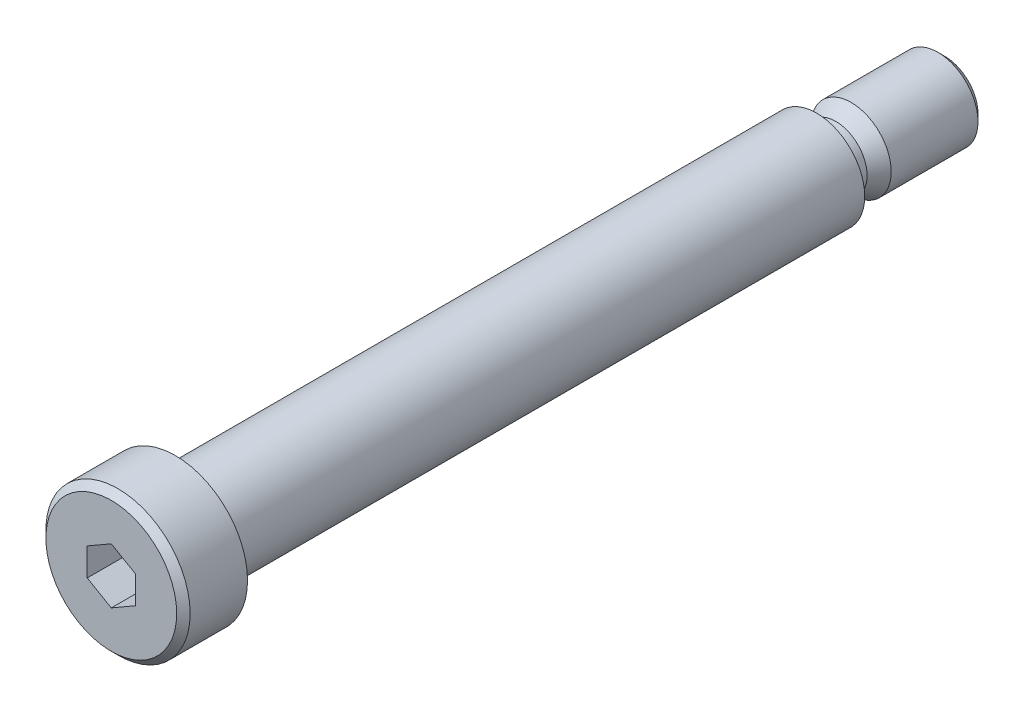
ISO-10303-21;
HEADER;
FILE_DESCRIPTION(('STEP AP214'),'2;1');
FILE_NAME('part.step','',(''),(''),'','','');
FILE_SCHEMA(('AUTOMOTIVE_DESIGN { 1 0 10303 214 1 1 1 1 }'));
ENDSEC;
DATA;
#1=APPLICATION_CONTEXT('core data for automotive mechanical design processes');
#2=APPLICATION_PROTOCOL_DEFINITION('international standard','automotive_design',2000,#1);
#3=PRODUCT_CONTEXT('',#1,'mechanical');
#4=PRODUCT('Part','Part','',(#3));
#5=PRODUCT_RELATED_PRODUCT_CATEGORY('part','',(#4));
#6=PRODUCT_DEFINITION_FORMATION('','',#4);
#7=PRODUCT_DEFINITION_CONTEXT('part definition',#1,'design');
#8=PRODUCT_DEFINITION('design','',#6,#7);
#9=PRODUCT_DEFINITION_SHAPE('','',#8);
#10=(LENGTH_UNIT() NAMED_UNIT(*) SI_UNIT(.MILLI.,.METRE.));
#11=(NAMED_UNIT(*) PLANE_ANGLE_UNIT() SI_UNIT($,.RADIAN.));
#12=(NAMED_UNIT(*) SI_UNIT($,.STERADIAN.) SOLID_ANGLE_UNIT());
#13=UNCERTAINTY_MEASURE_WITH_UNIT(LENGTH_MEASURE(1.E-05),#10,'distance_accuracy_value','');
#14=(GEOMETRIC_REPRESENTATION_CONTEXT(3) GLOBAL_UNCERTAINTY_ASSIGNED_CONTEXT((#13)) GLOBAL_UNIT_ASSIGNED_CONTEXT((#10,
#11,#12)) REPRESENTATION_CONTEXT('',''));
#15=CARTESIAN_POINT('',(0.,0.,0.));
#16=DIRECTION('',(0.,0.,1.));
#17=DIRECTION('',(1.,0.,0.));
#18=AXIS2_PLACEMENT_3D('',#15,#16,#17);
#19=CARTESIAN_POINT('',(0.,4.07999999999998,4.));
#20=DIRECTION('',(0.,0.,-1.));
#21=DIRECTION('',(-1.,0.,0.));
#22=AXIS2_PLACEMENT_3D('',#19,#20,#21);
#23=PLANE('',#22);
#24=CARTESIAN_POINT('',(0.,0.,4.));
#25=DIRECTION('',(0.,0.,1.));
#26=DIRECTION('',(1.,0.,0.));
#27=AXIS2_PLACEMENT_3D('',#24,#25,#26);
#28=CIRCLE('',#27,4.08);
#29=CARTESIAN_POINT('',(4.08,0.,4.));
#30=VERTEX_POINT('',#29);
#31=EDGE_CURVE('E154',#30,#30,#28,.T.);
#32=ORIENTED_EDGE('',*,*,#31,.T.);
#33=EDGE_LOOP('',(#32));
#34=FACE_BOUND('',#33,.T.);
#35=DIRECTION('',(0.,1.,0.));
#36=VECTOR('',#35,1.);
#37=CARTESIAN_POINT('',(1.5,4.07999999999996,4.));
#38=LINE('',#37,#36);
#39=CARTESIAN_POINT('',(1.5,-0.866025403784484,4.));
#40=VERTEX_POINT('',#39);
#41=CARTESIAN_POINT('',(1.5,0.866025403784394,4.));
#42=VERTEX_POINT('',#41);
#43=EDGE_CURVE('E11',#40,#42,#38,.T.);
#44=ORIENTED_EDGE('',*,*,#43,.F.);
#45=DIRECTION('',(0.866025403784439,0.5,0.));
#46=VECTOR('',#45,1.);
#47=CARTESIAN_POINT('',(2.51669182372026,-0.279038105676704,4.));
#48=LINE('',#47,#46);
#49=CARTESIAN_POINT('',(0.,-1.73205080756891,4.));
#50=VERTEX_POINT('',#49);
#51=EDGE_CURVE('E24',#50,#40,#48,.T.);
#52=ORIENTED_EDGE('',*,*,#51,.F.);
#53=DIRECTION('',(0.866025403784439,-0.5,0.));
#54=VECTOR('',#53,1.);
#55=CARTESIAN_POINT('',(-2.51669182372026,-0.279038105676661,4.));
#56=LINE('',#55,#54);
#57=CARTESIAN_POINT('',(-1.5,-0.866025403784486,4.));
#58=VERTEX_POINT('',#57);
#59=EDGE_CURVE('E210',#58,#50,#56,.T.);
#60=ORIENTED_EDGE('',*,*,#59,.F.);
#61=DIRECTION('',(0.,-1.,0.));
#62=VECTOR('',#61,1.);
#63=CARTESIAN_POINT('',(-1.5,4.07999999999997,4.));
#64=LINE('',#63,#62);
#65=CARTESIAN_POINT('',(-1.5,0.866025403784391,4.));
#66=VERTEX_POINT('',#65);
#67=EDGE_CURVE('E207',#66,#58,#64,.T.);
#68=ORIENTED_EDGE('',*,*,#67,.F.);
#69=DIRECTION('',(-0.866025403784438,-0.5,0.));
#70=VECTOR('',#69,1.);
#71=CARTESIAN_POINT('',(1.01669182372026,2.31903810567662,4.));
#72=LINE('',#71,#70);
#73=CARTESIAN_POINT('',(0.,1.73205080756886,4.));
#74=VERTEX_POINT('',#73);
#75=EDGE_CURVE('E204',#74,#66,#72,.T.);
#76=ORIENTED_EDGE('',*,*,#75,.F.);
#77=DIRECTION('',(-0.866025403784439,0.5,0.));
#78=VECTOR('',#77,1.);
#79=CARTESIAN_POINT('',(-1.01669182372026,2.31903810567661,4.));
#80=LINE('',#79,#78);
#81=EDGE_CURVE('E201',#42,#74,#80,.T.);
#82=ORIENTED_EDGE('',*,*,#81,.F.);
#83=EDGE_LOOP('',(#44,#52,#60,#68,#76,#82));
#84=FACE_BOUND('',#83,.T.);
#85=ADVANCED_FACE('F16',(#34,#84),#23,.F.);
#86=CARTESIAN_POINT('',(0.,0.,-48.));
#87=DIRECTION('',(0.,0.,1.));
#88=DIRECTION('',(1.,0.,0.));
#89=AXIS2_PLACEMENT_3D('',#86,#87,#88);
#90=PLANE('',#89);
#91=CARTESIAN_POINT('',(0.,0.,-48.));
#92=DIRECTION('',(0.,0.,1.));
#93=DIRECTION('',(1.,0.,0.));
#94=AXIS2_PLACEMENT_3D('',#91,#92,#93);
#95=CIRCLE('',#94,2.067);
#96=CARTESIAN_POINT('',(2.06700000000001,0.,-48.));
#97=VERTEX_POINT('',#96);
#98=EDGE_CURVE('E197',#97,#97,#95,.T.);
#99=ORIENTED_EDGE('',*,*,#98,.F.);
#100=EDGE_LOOP('',(#99));
#101=FACE_BOUND('',#100,.T.);
#102=ADVANCED_FACE('F222',(#101),#90,.F.);
#103=CARTESIAN_POINT('',(0.,0.,-48.));
#104=DIRECTION('',(0.,0.,1.));
#105=DIRECTION('',(1.,0.,0.));
#106=AXIS2_PLACEMENT_3D('',#103,#104,#105);
#107=CONICAL_SURFACE('',#106,2.067,0.785398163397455);
#108=CARTESIAN_POINT('',(3.7470027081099E-13,0.,-47.567));
#109=DIRECTION('',(0.,0.,1.));
#110=DIRECTION('',(1.,0.,0.));
#111=AXIS2_PLACEMENT_3D('',#108,#109,#110);
#112=CIRCLE('',#111,2.5);
#113=CARTESIAN_POINT('',(2.50000000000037,0.,-47.567));
#114=VERTEX_POINT('',#113);
#115=EDGE_CURVE('E193',#114,#114,#112,.T.);
#116=ORIENTED_EDGE('',*,*,#115,.F.);
#117=EDGE_LOOP('',(#116));
#118=FACE_BOUND('',#117,.T.);
#119=ORIENTED_EDGE('',*,*,#98,.T.);
#120=EDGE_LOOP('',(#119));
#121=FACE_BOUND('',#120,.T.);
#122=ADVANCED_FACE('F226',(#118,#121),#107,.T.);
#123=CARTESIAN_POINT('',(0.,0.,4.));
#124=DIRECTION('',(0.,0.,1.));
#125=DIRECTION('',(1.,0.,0.));
#126=AXIS2_PLACEMENT_3D('',#123,#124,#125);
#127=CYLINDRICAL_SURFACE('',#126,2.5);
#128=CARTESIAN_POINT('',(3.7470027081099E-13,0.,-42.1526279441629));
#129=DIRECTION('',(0.,0.,1.));
#130=DIRECTION('',(1.,0.,0.));
#131=AXIS2_PLACEMENT_3D('',#128,#129,#130);
#132=CIRCLE('',#131,2.5);
#133=CARTESIAN_POINT('',(2.50000000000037,0.,-42.1526279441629));
#134=VERTEX_POINT('',#133);
#135=EDGE_CURVE('E189',#134,#134,#132,.T.);
#136=ORIENTED_EDGE('',*,*,#135,.F.);
#137=EDGE_LOOP('',(#136));
#138=FACE_BOUND('',#137,.T.);
#139=ORIENTED_EDGE('',*,*,#115,.T.);
#140=EDGE_LOOP('',(#139));
#141=FACE_BOUND('',#140,.T.);
#142=ADVANCED_FACE('F237',(#138,#141),#127,.T.);
#143=CARTESIAN_POINT('',(3.7470027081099E-13,0.,-42.1526279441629));
#144=DIRECTION('',(0.,0.,-1.));
#145=DIRECTION('',(-1.,0.,0.));
#146=AXIS2_PLACEMENT_3D('',#143,#144,#145);
#147=CONICAL_SURFACE('',#146,2.5,0.523598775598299);
#148=CARTESIAN_POINT('',(3.7470027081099E-13,0.,-41.2));
#149=DIRECTION('',(0.,0.,1.));
#150=DIRECTION('',(1.,0.,0.));
#151=AXIS2_PLACEMENT_3D('',#148,#149,#150);
#152=CIRCLE('',#151,1.95);
#153=CARTESIAN_POINT('',(1.95000000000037,0.,-41.2));
#154=VERTEX_POINT('',#153);
#155=EDGE_CURVE('E185',#154,#154,#152,.T.);
#156=ORIENTED_EDGE('',*,*,#155,.F.);
#157=EDGE_LOOP('',(#156));
#158=FACE_BOUND('',#157,.T.);
#159=ORIENTED_EDGE('',*,*,#135,.T.);
#160=EDGE_LOOP('',(#159));
#161=FACE_BOUND('',#160,.T.);
#162=ADVANCED_FACE('F247',(#158,#161),#147,.T.);
#163=CARTESIAN_POINT('',(0.,0.,4.));
#164=DIRECTION('',(0.,0.,1.));
#165=DIRECTION('',(1.,0.,0.));
#166=AXIS2_PLACEMENT_3D('',#163,#164,#165);
#167=CYLINDRICAL_SURFACE('',#166,1.95);
#168=CARTESIAN_POINT('',(2.08166817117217E-13,0.,-40.4));
#169=DIRECTION('',(0.,0.,1.));
#170=DIRECTION('',(1.,0.,0.));
#171=AXIS2_PLACEMENT_3D('',#168,#169,#170);
#172=CIRCLE('',#171,1.95);
#173=CARTESIAN_POINT('',(1.95000000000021,0.,-40.4));
#174=VERTEX_POINT('',#173);
#175=EDGE_CURVE('E181',#174,#174,#172,.T.);
#176=ORIENTED_EDGE('',*,*,#175,.F.);
#177=EDGE_LOOP('',(#176));
#178=FACE_BOUND('',#177,.T.);
#179=ORIENTED_EDGE('',*,*,#155,.T.);
#180=EDGE_LOOP('',(#179));
#181=FACE_BOUND('',#180,.T.);
#182=ADVANCED_FACE('F257',(#178,#181),#167,.T.);
#183=CARTESIAN_POINT('',(2.08166817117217E-13,0.,-40.4));
#184=DIRECTION('',(0.,0.,1.));
#185=DIRECTION('',(1.,0.,0.));
#186=AXIS2_PLACEMENT_3D('',#183,#184,#185);
#187=TOROIDAL_SURFACE('',#186,2.35,0.4);
#188=ORIENTED_EDGE('',*,*,#175,.T.);
#189=EDGE_LOOP('',(#188));
#190=FACE_BOUND('',#189,.T.);
#191=CARTESIAN_POINT('',(2.08166817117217E-13,0.,-40.));
#192=DIRECTION('',(0.,0.,1.));
#193=DIRECTION('',(1.,0.,0.));
#194=AXIS2_PLACEMENT_3D('',#191,#192,#193);
#195=CIRCLE('',#194,2.35);
#196=CARTESIAN_POINT('',(2.35000000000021,0.,-40.));
#197=VERTEX_POINT('',#196);
#198=EDGE_CURVE('E177',#197,#197,#195,.T.);
#199=ORIENTED_EDGE('',*,*,#198,.F.);
#200=EDGE_LOOP('',(#199));
#201=FACE_BOUND('',#200,.T.);
#202=ADVANCED_FACE('F267',(#190,#201),#187,.F.);
#203=CARTESIAN_POINT('',(2.08166817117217E-13,2.34999999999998,-40.));
#204=DIRECTION('',(0.,0.,1.));
#205=DIRECTION('',(1.,0.,0.));
#206=AXIS2_PLACEMENT_3D('',#203,#204,#205);
#207=PLANE('',#206);
#208=CARTESIAN_POINT('',(2.08166817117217E-13,0.,-40.));
#209=DIRECTION('',(0.,0.,1.));
#210=DIRECTION('',(1.,0.,0.));
#211=AXIS2_PLACEMENT_3D('',#208,#209,#210);
#212=CIRCLE('',#211,3.);
#213=CARTESIAN_POINT('',(3.00000000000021,0.,-40.));
#214=VERTEX_POINT('',#213);
#215=EDGE_CURVE('E173',#214,#214,#212,.T.);
#216=ORIENTED_EDGE('',*,*,#215,.F.);
#217=EDGE_LOOP('',(#216));
#218=FACE_BOUND('',#217,.T.);
#219=ORIENTED_EDGE('',*,*,#198,.T.);
#220=EDGE_LOOP('',(#219));
#221=FACE_BOUND('',#220,.T.);
#222=ADVANCED_FACE('F277',(#218,#221),#207,.F.);
#223=CARTESIAN_POINT('',(0.,0.,4.));
#224=DIRECTION('',(0.,0.,1.));
#225=DIRECTION('',(1.,0.,0.));
#226=AXIS2_PLACEMENT_3D('',#223,#224,#225);
#227=CYLINDRICAL_SURFACE('',#226,3.);
#228=CARTESIAN_POINT('',(0.,0.,-0.68));
#229=DIRECTION('',(0.,0.,1.));
#230=DIRECTION('',(1.,0.,0.));
#231=AXIS2_PLACEMENT_3D('',#228,#229,#230);
#232=CIRCLE('',#231,3.);
#233=CARTESIAN_POINT('',(3.,0.,-0.68));
#234=VERTEX_POINT('',#233);
#235=EDGE_CURVE('E169',#234,#234,#232,.T.);
#236=ORIENTED_EDGE('',*,*,#235,.F.);
#237=EDGE_LOOP('',(#236));
#238=FACE_BOUND('',#237,.T.);
#239=ORIENTED_EDGE('',*,*,#215,.T.);
#240=EDGE_LOOP('',(#239));
#241=FACE_BOUND('',#240,.T.);
#242=ADVANCED_FACE('F287',(#238,#241),#227,.T.);
#243=CARTESIAN_POINT('',(0.,0.,-0.34));
#244=DIRECTION('',(0.,0.,1.));
#245=DIRECTION('',(1.,0.,0.));
#246=AXIS2_PLACEMENT_3D('',#243,#244,#245);
#247=TOROIDAL_SURFACE('',#246,3.0765,0.3485);
#248=ORIENTED_EDGE('',*,*,#235,.T.);
#249=EDGE_LOOP('',(#248));
#250=FACE_BOUND('',#249,.T.);
#251=CARTESIAN_POINT('',(0.,0.,0.));
#252=DIRECTION('',(0.,0.,1.));
#253=DIRECTION('',(1.,0.,0.));
#254=AXIS2_PLACEMENT_3D('',#251,#252,#253);
#255=CIRCLE('',#254,3.);
#256=CARTESIAN_POINT('',(3.,0.,0.));
#257=VERTEX_POINT('',#256);
#258=EDGE_CURVE('E165',#257,#257,#255,.T.);
#259=ORIENTED_EDGE('',*,*,#258,.F.);
#260=EDGE_LOOP('',(#259));
#261=FACE_BOUND('',#260,.T.);
#262=ADVANCED_FACE('F297',(#250,#261),#247,.F.);
#263=CARTESIAN_POINT('',(0.,2.99999999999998,0.));
#264=DIRECTION('',(0.,0.,1.));
#265=DIRECTION('',(1.,0.,0.));
#266=AXIS2_PLACEMENT_3D('',#263,#264,#265);
#267=PLANE('',#266);
#268=CARTESIAN_POINT('',(0.,0.,0.));
#269=DIRECTION('',(0.,0.,1.));
#270=DIRECTION('',(1.,0.,0.));
#271=AXIS2_PLACEMENT_3D('',#268,#269,#270);
#272=CIRCLE('',#271,4.5);
#273=CARTESIAN_POINT('',(4.5,0.,0.));
#274=VERTEX_POINT('',#273);
#275=EDGE_CURVE('E161',#274,#274,#272,.T.);
#276=ORIENTED_EDGE('',*,*,#275,.F.);
#277=EDGE_LOOP('',(#276));
#278=FACE_BOUND('',#277,.T.);
#279=ORIENTED_EDGE('',*,*,#258,.T.);
#280=EDGE_LOOP('',(#279));
#281=FACE_BOUND('',#280,.T.);
#282=ADVANCED_FACE('F307',(#278,#281),#267,.F.);
#283=CARTESIAN_POINT('',(0.,0.,4.));
#284=DIRECTION('',(0.,0.,1.));
#285=DIRECTION('',(1.,0.,0.));
#286=AXIS2_PLACEMENT_3D('',#283,#284,#285);
#287=CYLINDRICAL_SURFACE('',#286,4.5);
#288=CARTESIAN_POINT('',(0.,0.,3.58));
#289=DIRECTION('',(0.,0.,1.));
#290=DIRECTION('',(1.,0.,0.));
#291=AXIS2_PLACEMENT_3D('',#288,#289,#290);
#292=CIRCLE('',#291,4.5);
#293=CARTESIAN_POINT('',(4.5,0.,3.58));
#294=VERTEX_POINT('',#293);
#295=EDGE_CURVE('E157',#294,#294,#292,.T.);
#296=ORIENTED_EDGE('',*,*,#295,.F.);
#297=EDGE_LOOP('',(#296));
#298=FACE_BOUND('',#297,.T.);
#299=ORIENTED_EDGE('',*,*,#275,.T.);
#300=EDGE_LOOP('',(#299));
#301=FACE_BOUND('',#300,.T.);
#302=ADVANCED_FACE('F317',(#298,#301),#287,.T.);
#303=CARTESIAN_POINT('',(0.,0.,3.58));
#304=DIRECTION('',(0.,0.,-1.));
#305=DIRECTION('',(-1.,0.,0.));
#306=AXIS2_PLACEMENT_3D('',#303,#304,#305);
#307=CONICAL_SURFACE('',#306,4.5,0.785398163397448);
#308=ORIENTED_EDGE('',*,*,#31,.F.);
#309=EDGE_LOOP('',(#308));
#310=FACE_BOUND('',#309,.T.);
#311=ORIENTED_EDGE('',*,*,#295,.T.);
#312=EDGE_LOOP('',(#311));
#313=FACE_BOUND('',#312,.T.);
#314=ADVANCED_FACE('F327',(#310,#313),#307,.T.);
#315=CARTESIAN_POINT('',(1.5,0.866025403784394,1.5));
#316=DIRECTION('',(-1.,0.,0.));
#317=DIRECTION('',(0.,1.,0.));
#318=AXIS2_PLACEMENT_3D('',#315,#316,#317);
#319=PLANE('',#318);
#320=ORIENTED_EDGE('',*,*,#43,.T.);
#321=DIRECTION('',(0.,0.,1.));
#322=VECTOR('',#321,1.);
#323=CARTESIAN_POINT('',(1.5,0.866025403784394,1.5));
#324=LINE('',#323,#322);
#325=CARTESIAN_POINT('',(1.5,0.866025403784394,1.5));
#326=VERTEX_POINT('',#325);
#327=EDGE_CURVE('E35',#326,#42,#324,.T.);
#328=ORIENTED_EDGE('',*,*,#327,.F.);
#329=DIRECTION('',(0.,-1.,0.));
#330=VECTOR('',#329,1.);
#331=CARTESIAN_POINT('',(1.5,0.866025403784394,1.5));
#332=LINE('',#331,#330);
#333=CARTESIAN_POINT('',(1.5,0.,1.5));
#334=VERTEX_POINT('',#333);
#335=EDGE_CURVE('E121',#326,#334,#332,.T.);
#336=ORIENTED_EDGE('',*,*,#335,.T.);
#337=CARTESIAN_POINT('',(1.5,-0.866025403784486,1.5));
#338=VERTEX_POINT('',#337);
#339=EDGE_CURVE('E115',#334,#338,#332,.T.);
#340=ORIENTED_EDGE('',*,*,#339,.T.);
#341=DIRECTION('',(0.,0.,1.));
#342=VECTOR('',#341,1.);
#343=CARTESIAN_POINT('',(1.5,-0.866025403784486,1.5));
#344=LINE('',#343,#342);
#345=EDGE_CURVE('E118',#338,#40,#344,.T.);
#346=ORIENTED_EDGE('',*,*,#345,.T.);
#347=EDGE_LOOP('',(#320,#328,#336,#340,#346));
#348=FACE_BOUND('',#347,.T.);
#349=ADVANCED_FACE('F117',(#348),#319,.T.);
#350=CARTESIAN_POINT('',(1.5,-0.866025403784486,1.5));
#351=DIRECTION('',(-0.5,0.866025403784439,0.));
#352=DIRECTION('',(0.866025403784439,0.5,0.));
#353=AXIS2_PLACEMENT_3D('',#350,#351,#352);
#354=PLANE('',#353);
#355=ORIENTED_EDGE('',*,*,#51,.T.);
#356=ORIENTED_EDGE('',*,*,#345,.F.);
#357=DIRECTION('',(-0.866025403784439,-0.5,0.));
#358=VECTOR('',#357,1.);
#359=CARTESIAN_POINT('',(1.5,-0.866025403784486,1.5));
#360=LINE('',#359,#358);
#361=CARTESIAN_POINT('',(0.750000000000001,-1.2990381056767,1.5));
#362=VERTEX_POINT('',#361);
#363=EDGE_CURVE('E126',#338,#362,#360,.T.);
#364=ORIENTED_EDGE('',*,*,#363,.T.);
#365=CARTESIAN_POINT('',(0.,-1.73205080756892,1.5));
#366=VERTEX_POINT('',#365);
#367=EDGE_CURVE('E133',#362,#366,#360,.T.);
#368=ORIENTED_EDGE('',*,*,#367,.T.);
#369=DIRECTION('',(0.,0.,1.));
#370=VECTOR('',#369,1.);
#371=CARTESIAN_POINT('',(0.,-1.73205080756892,1.5));
#372=LINE('',#371,#370);
#373=EDGE_CURVE('E137',#366,#50,#372,.T.);
#374=ORIENTED_EDGE('',*,*,#373,.T.);
#375=EDGE_LOOP('',(#355,#356,#364,#368,#374));
#376=FACE_BOUND('',#375,.T.);
#377=ADVANCED_FACE('F135',(#376),#354,.T.);
#378=CARTESIAN_POINT('',(0.,-1.73205080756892,1.5));
#379=DIRECTION('',(0.5,0.866025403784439,0.));
#380=DIRECTION('',(0.866025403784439,-0.5,0.));
#381=AXIS2_PLACEMENT_3D('',#378,#379,#380);
#382=PLANE('',#381);
#383=ORIENTED_EDGE('',*,*,#59,.T.);
#384=ORIENTED_EDGE('',*,*,#373,.F.);
#385=DIRECTION('',(-0.866025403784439,0.5,0.));
#386=VECTOR('',#385,1.);
#387=CARTESIAN_POINT('',(0.,-1.73205080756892,1.5));
#388=LINE('',#387,#386);
#389=CARTESIAN_POINT('',(-0.750000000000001,-1.29903810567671,1.5));
#390=VERTEX_POINT('',#389);
#391=EDGE_CURVE('E527',#366,#390,#388,.T.);
#392=ORIENTED_EDGE('',*,*,#391,.T.);
#393=CARTESIAN_POINT('',(-1.5,-0.866025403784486,1.5));
#394=VERTEX_POINT('',#393);
#395=EDGE_CURVE('E132',#390,#394,#388,.T.);
#396=ORIENTED_EDGE('',*,*,#395,.T.);
#397=DIRECTION('',(0.,0.,1.));
#398=VECTOR('',#397,1.);
#399=CARTESIAN_POINT('',(-1.5,-0.866025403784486,1.5));
#400=LINE('',#399,#398);
#401=EDGE_CURVE('E146',#394,#58,#400,.T.);
#402=ORIENTED_EDGE('',*,*,#401,.T.);
#403=EDGE_LOOP('',(#383,#384,#392,#396,#402));
#404=FACE_BOUND('',#403,.T.);
#405=ADVANCED_FACE('F359',(#404),#382,.T.);
#406=CARTESIAN_POINT('',(-1.5,-0.866025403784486,1.5));
#407=DIRECTION('',(1.,0.,0.));
#408=DIRECTION('',(0.,-1.,0.));
#409=AXIS2_PLACEMENT_3D('',#406,#407,#408);
#410=PLANE('',#409);
#411=ORIENTED_EDGE('',*,*,#67,.T.);
#412=ORIENTED_EDGE('',*,*,#401,.F.);
#413=DIRECTION('',(0.,1.,0.));
#414=VECTOR('',#413,1.);
#415=CARTESIAN_POINT('',(-1.5,-0.866025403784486,1.5));
#416=LINE('',#415,#414);
#417=CARTESIAN_POINT('',(-1.5,0.,1.5));
#418=VERTEX_POINT('',#417);
#419=EDGE_CURVE('E523',#394,#418,#416,.T.);
#420=ORIENTED_EDGE('',*,*,#419,.T.);
#421=CARTESIAN_POINT('',(-1.5,0.866025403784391,1.5));
#422=VERTEX_POINT('',#421);
#423=EDGE_CURVE('E512',#418,#422,#416,.T.);
#424=ORIENTED_EDGE('',*,*,#423,.T.);
#425=DIRECTION('',(0.,0.,1.));
#426=VECTOR('',#425,1.);
#427=CARTESIAN_POINT('',(-1.5,0.866025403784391,1.5));
#428=LINE('',#427,#426);
#429=EDGE_CURVE('E498',#422,#66,#428,.T.);
#430=ORIENTED_EDGE('',*,*,#429,.T.);
#431=EDGE_LOOP('',(#411,#412,#420,#424,#430));
#432=FACE_BOUND('',#431,.T.);
#433=ADVANCED_FACE('F368',(#432),#410,.T.);
#434=CARTESIAN_POINT('',(-1.5,0.866025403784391,1.5));
#435=DIRECTION('',(0.5,-0.866025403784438,0.));
#436=DIRECTION('',(-0.866025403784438,-0.5,0.));
#437=AXIS2_PLACEMENT_3D('',#434,#435,#436);
#438=PLANE('',#437);
#439=ORIENTED_EDGE('',*,*,#75,.T.);
#440=ORIENTED_EDGE('',*,*,#429,.F.);
#441=DIRECTION('',(0.866025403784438,0.5,0.));
#442=VECTOR('',#441,1.);
#443=CARTESIAN_POINT('',(-1.5,0.866025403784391,1.5));
#444=LINE('',#443,#442);
#445=CARTESIAN_POINT('',(-0.750000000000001,1.29903810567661,1.5));
#446=VERTEX_POINT('',#445);
#447=EDGE_CURVE('E515',#422,#446,#444,.T.);
#448=ORIENTED_EDGE('',*,*,#447,.T.);
#449=CARTESIAN_POINT('',(0.,1.73205080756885,1.5));
#450=VERTEX_POINT('',#449);
#451=EDGE_CURVE('E520',#446,#450,#444,.T.);
#452=ORIENTED_EDGE('',*,*,#451,.T.);
#453=DIRECTION('',(0.,0.,1.));
#454=VECTOR('',#453,1.);
#455=CARTESIAN_POINT('',(0.,1.73205080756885,1.5));
#456=LINE('',#455,#454);
#457=EDGE_CURVE('E484',#450,#74,#456,.T.);
#458=ORIENTED_EDGE('',*,*,#457,.T.);
#459=EDGE_LOOP('',(#439,#440,#448,#452,#458));
#460=FACE_BOUND('',#459,.T.);
#461=ADVANCED_FACE('F378',(#460),#438,.T.);
#462=CARTESIAN_POINT('',(0.,1.73205080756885,1.5));
#463=DIRECTION('',(-0.5,-0.866025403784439,0.));
#464=DIRECTION('',(-0.866025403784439,0.5,0.));
#465=AXIS2_PLACEMENT_3D('',#462,#463,#464);
#466=PLANE('',#465);
#467=ORIENTED_EDGE('',*,*,#81,.T.);
#468=ORIENTED_EDGE('',*,*,#457,.F.);
#469=DIRECTION('',(0.866025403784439,-0.5,0.));
#470=VECTOR('',#469,1.);
#471=CARTESIAN_POINT('',(0.,1.73205080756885,1.5));
#472=LINE('',#471,#470);
#473=CARTESIAN_POINT('',(0.750000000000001,1.29903810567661,1.5));
#474=VERTEX_POINT('',#473);
#475=EDGE_CURVE('E485',#450,#474,#472,.T.);
#476=ORIENTED_EDGE('',*,*,#475,.T.);
#477=EDGE_CURVE('E488',#474,#326,#472,.T.);
#478=ORIENTED_EDGE('',*,*,#477,.T.);
#479=ORIENTED_EDGE('',*,*,#327,.T.);
#480=EDGE_LOOP('',(#467,#468,#476,#478,#479));
#481=FACE_BOUND('',#480,.T.);
#482=ADVANCED_FACE('F389',(#481),#466,.T.);
#483=CARTESIAN_POINT('',(1.5,0.866025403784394,1.5));
#484=DIRECTION('',(0.,0.,1.));
#485=DIRECTION('',(-1.,0.,0.));
#486=AXIS2_PLACEMENT_3D('',#483,#484,#485);
#487=PLANE('',#486);
#488=ORIENTED_EDGE('',*,*,#335,.F.);
#489=ORIENTED_EDGE('',*,*,#477,.F.);
#490=CARTESIAN_POINT('',(0.,0.,1.5));
#491=DIRECTION('',(0.,0.,1.));
#492=DIRECTION('',(1.,0.,0.));
#493=AXIS2_PLACEMENT_3D('',#490,#491,#492);
#494=CIRCLE('',#493,1.5);
#495=EDGE_CURVE('E150',#334,#474,#494,.T.);
#496=ORIENTED_EDGE('',*,*,#495,.F.);
#497=EDGE_LOOP('',(#488,#489,#496));
#498=FACE_BOUND('',#497,.T.);
#499=ADVANCED_FACE('F400',(#498),#487,.T.);
#500=ORIENTED_EDGE('',*,*,#475,.F.);
#501=ORIENTED_EDGE('',*,*,#451,.F.);
#502=CARTESIAN_POINT('',(0.,0.,1.5));
#503=DIRECTION('',(0.,0.,1.));
#504=DIRECTION('',(1.,0.,0.));
#505=AXIS2_PLACEMENT_3D('',#502,#503,#504);
#506=CIRCLE('',#505,1.5);
#507=EDGE_CURVE('E144',#474,#446,#506,.T.);
#508=ORIENTED_EDGE('',*,*,#507,.F.);
#509=EDGE_LOOP('',(#500,#501,#508));
#510=FACE_BOUND('',#509,.T.);
#511=ADVANCED_FACE('F410',(#510),#487,.T.);
#512=ORIENTED_EDGE('',*,*,#447,.F.);
#513=ORIENTED_EDGE('',*,*,#423,.F.);
#514=EDGE_CURVE('E517',#446,#418,#506,.T.);
#515=ORIENTED_EDGE('',*,*,#514,.F.);
#516=EDGE_LOOP('',(#512,#513,#515));
#517=FACE_BOUND('',#516,.T.);
#518=ADVANCED_FACE('F421',(#517),#487,.T.);
#519=ORIENTED_EDGE('',*,*,#419,.F.);
#520=ORIENTED_EDGE('',*,*,#395,.F.);
#521=EDGE_CURVE('E540',#418,#390,#506,.T.);
#522=ORIENTED_EDGE('',*,*,#521,.F.);
#523=EDGE_LOOP('',(#519,#520,#522));
#524=FACE_BOUND('',#523,.T.);
#525=ADVANCED_FACE('F431',(#524),#487,.T.);
#526=ORIENTED_EDGE('',*,*,#391,.F.);
#527=ORIENTED_EDGE('',*,*,#367,.F.);
#528=EDGE_CURVE('E142',#390,#362,#506,.T.);
#529=ORIENTED_EDGE('',*,*,#528,.F.);
#530=EDGE_LOOP('',(#526,#527,#529));
#531=FACE_BOUND('',#530,.T.);
#532=ADVANCED_FACE('F441',(#531),#487,.T.);
#533=ORIENTED_EDGE('',*,*,#363,.F.);
#534=ORIENTED_EDGE('',*,*,#339,.F.);
#535=EDGE_CURVE('E129',#362,#334,#506,.T.);
#536=ORIENTED_EDGE('',*,*,#535,.F.);
#537=EDGE_LOOP('',(#533,#534,#536));
#538=FACE_BOUND('',#537,.T.);
#539=ADVANCED_FACE('F127',(#538),#487,.T.);
#540=CARTESIAN_POINT('',(0.,0.,0.633974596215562));
#541=DIRECTION('',(0.,0.,1.));
#542=DIRECTION('',(1.,0.,0.));
#543=AXIS2_PLACEMENT_3D('',#540,#541,#542);
#544=CONICAL_SURFACE('',#543,0.,1.0471975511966);
#545=ORIENTED_EDGE('',*,*,#495,.T.);
#546=ORIENTED_EDGE('',*,*,#507,.T.);
#547=ORIENTED_EDGE('',*,*,#514,.T.);
#548=ORIENTED_EDGE('',*,*,#521,.T.);
#549=ORIENTED_EDGE('',*,*,#528,.T.);
#550=ORIENTED_EDGE('',*,*,#535,.T.);
#551=EDGE_LOOP('',(#545,#546,#547,#548,#549,#550));
#552=FACE_BOUND('',#551,.T.);
#553=CARTESIAN_POINT('',(0.,0.,0.633974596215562));
#554=VERTEX_POINT('',#553);
#555=VERTEX_LOOP('',#554);
#556=FACE_BOUND('',#555,.T.);
#557=ADVANCED_FACE('F460',(#552,#556),#544,.F.);
#558=CLOSED_SHELL('',(#85,#102,#122,#142,#162,#182,#202,#222,#242,#262,#282,#302,#314,#349,#377,
#405,#433,#461,#482,#499,#511,#518,#525,#532,#539,#557));
#559=MANIFOLD_SOLID_BREP('B1',#558);
#560=ADVANCED_BREP_SHAPE_REPRESENTATION('',(#18,#559),#14);
#561=SHAPE_DEFINITION_REPRESENTATION(#9,#560);
ENDSEC;
END-ISO-10303-21;
